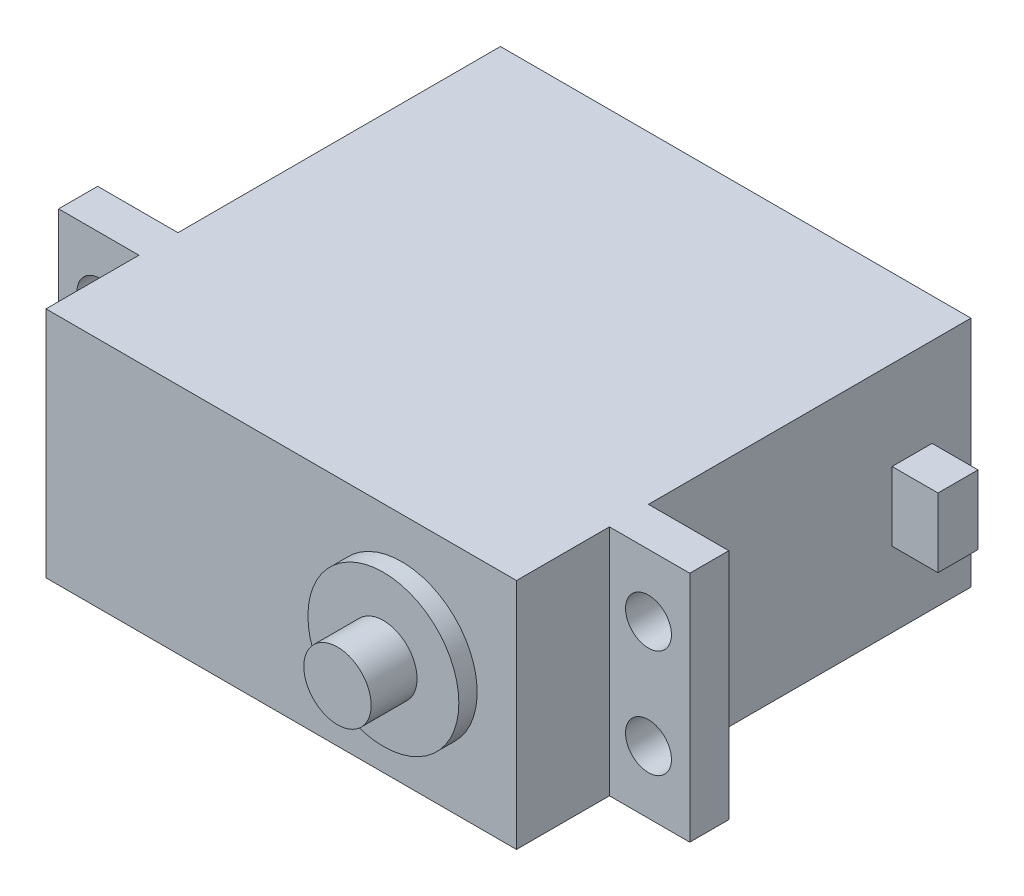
ISO-10303-21;
HEADER;
FILE_DESCRIPTION(('STEP AP214'),'2;1');
FILE_NAME('part.step','',(''),(''),'','','');
FILE_SCHEMA(('AUTOMOTIVE_DESIGN { 1 0 10303 214 1 1 1 1 }'));
ENDSEC;
DATA;
#1=APPLICATION_CONTEXT('core data for automotive mechanical design processes');
#2=APPLICATION_PROTOCOL_DEFINITION('international standard','automotive_design',2000,#1);
#3=PRODUCT_CONTEXT('',#1,'mechanical');
#4=PRODUCT('Part','Part','',(#3));
#5=PRODUCT_RELATED_PRODUCT_CATEGORY('part','',(#4));
#6=PRODUCT_DEFINITION_FORMATION('','',#4);
#7=PRODUCT_DEFINITION_CONTEXT('part definition',#1,'design');
#8=PRODUCT_DEFINITION('design','',#6,#7);
#9=PRODUCT_DEFINITION_SHAPE('','',#8);
#10=(LENGTH_UNIT() NAMED_UNIT(*) SI_UNIT(.MILLI.,.METRE.));
#11=(NAMED_UNIT(*) PLANE_ANGLE_UNIT() SI_UNIT($,.RADIAN.));
#12=(NAMED_UNIT(*) SI_UNIT($,.STERADIAN.) SOLID_ANGLE_UNIT());
#13=UNCERTAINTY_MEASURE_WITH_UNIT(LENGTH_MEASURE(1.E-05),#10,'distance_accuracy_value','');
#14=(GEOMETRIC_REPRESENTATION_CONTEXT(3) GLOBAL_UNCERTAINTY_ASSIGNED_CONTEXT((#13)) GLOBAL_UNIT_ASSIGNED_CONTEXT((#10,
#11,#12)) REPRESENTATION_CONTEXT('',''));
#15=CARTESIAN_POINT('',(0.,0.,0.));
#16=DIRECTION('',(0.,0.,1.));
#17=DIRECTION('',(1.,0.,0.));
#18=AXIS2_PLACEMENT_3D('',#15,#16,#17);
#19=CARTESIAN_POINT('',(41.,20.3,0.));
#20=DIRECTION('',(-1.,0.,0.));
#21=DIRECTION('',(0.,0.,1.));
#22=AXIS2_PLACEMENT_3D('',#19,#20,#21);
#23=PLANE('',#22);
#24=DIRECTION('',(0.,0.,-1.));
#25=VECTOR('',#24,1.);
#26=CARTESIAN_POINT('',(41.,0.,0.));
#27=LINE('',#26,#25);
#28=CARTESIAN_POINT('',(41.,0.,-11.5));
#29=VERTEX_POINT('',#28);
#30=CARTESIAN_POINT('',(41.,0.,-39.6));
#31=VERTEX_POINT('',#30);
#32=EDGE_CURVE('E247',#29,#31,#27,.T.);
#33=ORIENTED_EDGE('',*,*,#32,.T.);
#34=DIRECTION('',(0.,-1.,0.));
#35=VECTOR('',#34,1.);
#36=CARTESIAN_POINT('',(41.,20.3,-39.6));
#37=LINE('',#36,#35);
#38=CARTESIAN_POINT('',(41.,20.3,-39.6));
#39=VERTEX_POINT('',#38);
#40=EDGE_CURVE('E282',#39,#31,#37,.T.);
#41=ORIENTED_EDGE('',*,*,#40,.F.);
#42=DIRECTION('',(0.,0.,-1.));
#43=VECTOR('',#42,1.);
#44=CARTESIAN_POINT('',(41.,20.3,0.));
#45=LINE('',#44,#43);
#46=CARTESIAN_POINT('',(41.,20.3,-11.5));
#47=VERTEX_POINT('',#46);
#48=EDGE_CURVE('E220',#47,#39,#45,.T.);
#49=ORIENTED_EDGE('',*,*,#48,.F.);
#50=DIRECTION('',(0.,-1.,0.));
#51=VECTOR('',#50,1.);
#52=CARTESIAN_POINT('',(41.,20.3,-11.5));
#53=LINE('',#52,#51);
#54=EDGE_CURVE('E284',#47,#29,#53,.T.);
#55=ORIENTED_EDGE('',*,*,#54,.T.);
#56=EDGE_LOOP('',(#33,#41,#49,#55));
#57=FACE_BOUND('',#56,.T.);
#58=DIRECTION('',(0.,-1.,0.));
#59=VECTOR('',#58,1.);
#60=CARTESIAN_POINT('',(41.,12.5393101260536,-32.7313188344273));
#61=LINE('',#60,#59);
#62=CARTESIAN_POINT('',(41.,12.5393101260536,-32.7313188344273));
#63=VERTEX_POINT('',#62);
#64=CARTESIAN_POINT('',(41.,6.52387051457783,-32.7313188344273));
#65=VERTEX_POINT('',#64);
#66=EDGE_CURVE('E178',#63,#65,#61,.T.);
#67=ORIENTED_EDGE('',*,*,#66,.F.);
#68=DIRECTION('',(0.,0.,1.));
#69=VECTOR('',#68,1.);
#70=CARTESIAN_POINT('',(41.,12.5393101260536,-32.7313188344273));
#71=LINE('',#70,#69);
#72=CARTESIAN_POINT('',(41.,12.5393101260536,-36.2169006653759));
#73=VERTEX_POINT('',#72);
#74=EDGE_CURVE('E175',#73,#63,#71,.T.);
#75=ORIENTED_EDGE('',*,*,#74,.F.);
#76=DIRECTION('',(0.,1.,0.));
#77=VECTOR('',#76,1.);
#78=CARTESIAN_POINT('',(41.,12.5393101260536,-36.2169006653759));
#79=LINE('',#78,#77);
#80=CARTESIAN_POINT('',(41.,6.52387051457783,-36.2169006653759));
#81=VERTEX_POINT('',#80);
#82=EDGE_CURVE('E65',#81,#73,#79,.T.);
#83=ORIENTED_EDGE('',*,*,#82,.F.);
#84=DIRECTION('',(0.,0.,-1.));
#85=VECTOR('',#84,1.);
#86=CARTESIAN_POINT('',(41.,6.52387051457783,-32.7313188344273));
#87=LINE('',#86,#85);
#88=EDGE_CURVE('E60',#65,#81,#87,.T.);
#89=ORIENTED_EDGE('',*,*,#88,.F.);
#90=EDGE_LOOP('',(#67,#75,#83,#89));
#91=FACE_BOUND('',#90,.T.);
#92=ADVANCED_FACE('F43',(#57,#91),#23,.F.);
#93=CARTESIAN_POINT('',(0.,20.3,-8.10000000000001));
#94=DIRECTION('',(0.,0.,-1.));
#95=DIRECTION('',(-1.,0.,0.));
#96=AXIS2_PLACEMENT_3D('',#93,#94,#95);
#97=PLANE('',#96);
#98=CARTESIAN_POINT('',(44.4,5.45,-8.10000000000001));
#99=DIRECTION('',(0.,0.,1.));
#100=DIRECTION('',(1.,0.,0.));
#101=AXIS2_PLACEMENT_3D('',#98,#99,#100);
#102=CIRCLE('',#101,2.);
#103=CARTESIAN_POINT('',(46.4,5.45,-8.10000000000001));
#104=VERTEX_POINT('',#103);
#105=EDGE_CURVE('E179',#104,#104,#102,.T.);
#106=ORIENTED_EDGE('',*,*,#105,.F.);
#107=EDGE_LOOP('',(#106));
#108=FACE_BOUND('',#107,.T.);
#109=DIRECTION('',(1.,0.,0.));
#110=VECTOR('',#109,1.);
#111=CARTESIAN_POINT('',(0.,0.,-8.10000000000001));
#112=LINE('',#111,#110);
#113=CARTESIAN_POINT('',(41.,0.,-8.1));
#114=VERTEX_POINT('',#113);
#115=CARTESIAN_POINT('',(48.,0.,-8.1));
#116=VERTEX_POINT('',#115);
#117=EDGE_CURVE('E246',#114,#116,#112,.T.);
#118=ORIENTED_EDGE('',*,*,#117,.T.);
#119=DIRECTION('',(0.,-1.,0.));
#120=VECTOR('',#119,1.);
#121=CARTESIAN_POINT('',(48.,20.3,-8.1));
#122=LINE('',#121,#120);
#123=CARTESIAN_POINT('',(48.,20.3,-8.1));
#124=VERTEX_POINT('',#123);
#125=EDGE_CURVE('E288',#124,#116,#122,.T.);
#126=ORIENTED_EDGE('',*,*,#125,.F.);
#127=DIRECTION('',(1.,0.,0.));
#128=VECTOR('',#127,1.);
#129=CARTESIAN_POINT('',(0.,20.3,-8.10000000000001));
#130=LINE('',#129,#128);
#131=CARTESIAN_POINT('',(41.,20.3,-8.1));
#132=VERTEX_POINT('',#131);
#133=EDGE_CURVE('E219',#132,#124,#130,.T.);
#134=ORIENTED_EDGE('',*,*,#133,.F.);
#135=DIRECTION('',(0.,-1.,0.));
#136=VECTOR('',#135,1.);
#137=CARTESIAN_POINT('',(41.,20.3,-8.1));
#138=LINE('',#137,#136);
#139=EDGE_CURVE('E291',#132,#114,#138,.T.);
#140=ORIENTED_EDGE('',*,*,#139,.T.);
#141=EDGE_LOOP('',(#118,#126,#134,#140));
#142=FACE_BOUND('',#141,.T.);
#143=CARTESIAN_POINT('',(44.4,14.85,-8.10000000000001));
#144=DIRECTION('',(0.,0.,1.));
#145=DIRECTION('',(1.,0.,0.));
#146=AXIS2_PLACEMENT_3D('',#143,#144,#145);
#147=CIRCLE('',#146,2.);
#148=CARTESIAN_POINT('',(46.4,14.85,-8.10000000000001));
#149=VERTEX_POINT('',#148);
#150=EDGE_CURVE('E182',#149,#149,#147,.F.);
#151=ORIENTED_EDGE('',*,*,#150,.T.);
#152=EDGE_LOOP('',(#151));
#153=FACE_BOUND('',#152,.T.);
#154=ADVANCED_FACE('F310',(#108,#142,#153),#97,.F.);
#155=CARTESIAN_POINT('',(0.,20.3,-11.5));
#156=DIRECTION('',(0.,0.,-1.));
#157=DIRECTION('',(-1.,0.,0.));
#158=AXIS2_PLACEMENT_3D('',#155,#156,#157);
#159=PLANE('',#158);
#160=DIRECTION('',(1.,0.,0.));
#161=VECTOR('',#160,1.);
#162=CARTESIAN_POINT('',(0.,0.,-11.5));
#163=LINE('',#162,#161);
#164=CARTESIAN_POINT('',(48.,0.,-11.5));
#165=VERTEX_POINT('',#164);
#166=EDGE_CURVE('E252',#29,#165,#163,.T.);
#167=ORIENTED_EDGE('',*,*,#166,.F.);
#168=ORIENTED_EDGE('',*,*,#54,.F.);
#169=DIRECTION('',(1.,0.,0.));
#170=VECTOR('',#169,1.);
#171=CARTESIAN_POINT('',(0.,20.3,-11.5));
#172=LINE('',#171,#170);
#173=CARTESIAN_POINT('',(48.,20.3,-11.5));
#174=VERTEX_POINT('',#173);
#175=EDGE_CURVE('E224',#47,#174,#172,.T.);
#176=ORIENTED_EDGE('',*,*,#175,.T.);
#177=DIRECTION('',(0.,-1.,0.));
#178=VECTOR('',#177,1.);
#179=CARTESIAN_POINT('',(48.,20.3,-11.5));
#180=LINE('',#179,#178);
#181=EDGE_CURVE('E286',#174,#165,#180,.T.);
#182=ORIENTED_EDGE('',*,*,#181,.T.);
#183=EDGE_LOOP('',(#167,#168,#176,#182));
#184=FACE_BOUND('',#183,.T.);
#185=CARTESIAN_POINT('',(44.4,5.45,-11.5));
#186=DIRECTION('',(0.,0.,-1.));
#187=DIRECTION('',(-1.,0.,0.));
#188=AXIS2_PLACEMENT_3D('',#185,#186,#187);
#189=CIRCLE('',#188,2.);
#190=CARTESIAN_POINT('',(42.4,5.45,-11.5));
#191=VERTEX_POINT('',#190);
#192=EDGE_CURVE('E196',#191,#191,#189,.T.);
#193=ORIENTED_EDGE('',*,*,#192,.F.);
#194=EDGE_LOOP('',(#193));
#195=FACE_BOUND('',#194,.T.);
#196=CARTESIAN_POINT('',(44.4,14.85,-11.5));
#197=DIRECTION('',(0.,0.,-1.));
#198=DIRECTION('',(-1.,0.,0.));
#199=AXIS2_PLACEMENT_3D('',#196,#197,#198);
#200=CIRCLE('',#199,2.);
#201=CARTESIAN_POINT('',(42.4,14.85,-11.5));
#202=VERTEX_POINT('',#201);
#203=EDGE_CURVE('E47',#202,#202,#200,.F.);
#204=ORIENTED_EDGE('',*,*,#203,.T.);
#205=EDGE_LOOP('',(#204));
#206=FACE_BOUND('',#205,.T.);
#207=ADVANCED_FACE('F301',(#184,#195,#206),#159,.T.);
#208=CARTESIAN_POINT('',(0.,20.3,0.));
#209=DIRECTION('',(0.,0.,-1.));
#210=DIRECTION('',(-1.,0.,0.));
#211=AXIS2_PLACEMENT_3D('',#208,#209,#210);
#212=PLANE('',#211);
#213=CARTESIAN_POINT('',(31.,10.15,0.));
#214=DIRECTION('',(0.,0.,-1.));
#215=DIRECTION('',(-1.,0.,0.));
#216=AXIS2_PLACEMENT_3D('',#213,#214,#215);
#217=CIRCLE('',#216,6.575);
#218=CARTESIAN_POINT('',(24.425,10.15,0.));
#219=VERTEX_POINT('',#218);
#220=EDGE_CURVE('E12',#219,#219,#217,.F.);
#221=ORIENTED_EDGE('',*,*,#220,.F.);
#222=EDGE_LOOP('',(#221));
#223=FACE_BOUND('',#222,.T.);
#224=DIRECTION('',(1.,0.,0.));
#225=VECTOR('',#224,1.);
#226=CARTESIAN_POINT('',(0.,0.,0.));
#227=LINE('',#226,#225);
#228=CARTESIAN_POINT('',(0.,0.,0.));
#229=VERTEX_POINT('',#228);
#230=CARTESIAN_POINT('',(41.,0.,0.));
#231=VERTEX_POINT('',#230);
#232=EDGE_CURVE('E212',#229,#231,#227,.T.);
#233=ORIENTED_EDGE('',*,*,#232,.T.);
#234=DIRECTION('',(0.,-1.,0.));
#235=VECTOR('',#234,1.);
#236=CARTESIAN_POINT('',(41.,20.3,0.));
#237=LINE('',#236,#235);
#238=CARTESIAN_POINT('',(41.,20.3,0.));
#239=VERTEX_POINT('',#238);
#240=EDGE_CURVE('E52',#239,#231,#237,.T.);
#241=ORIENTED_EDGE('',*,*,#240,.F.);
#242=DIRECTION('',(1.,0.,0.));
#243=VECTOR('',#242,1.);
#244=CARTESIAN_POINT('',(0.,20.3,0.));
#245=LINE('',#244,#243);
#246=CARTESIAN_POINT('',(0.,20.3,0.));
#247=VERTEX_POINT('',#246);
#248=EDGE_CURVE('E213',#247,#239,#245,.T.);
#249=ORIENTED_EDGE('',*,*,#248,.F.);
#250=DIRECTION('',(0.,-1.,0.));
#251=VECTOR('',#250,1.);
#252=CARTESIAN_POINT('',(0.,20.3,0.));
#253=LINE('',#252,#251);
#254=EDGE_CURVE('E270',#247,#229,#253,.T.);
#255=ORIENTED_EDGE('',*,*,#254,.T.);
#256=EDGE_LOOP('',(#233,#241,#249,#255));
#257=FACE_BOUND('',#256,.T.);
#258=ADVANCED_FACE('F45',(#223,#257),#212,.F.);
#259=EDGE_CURVE('E244',#231,#114,#27,.T.);
#260=ORIENTED_EDGE('',*,*,#259,.T.);
#261=ORIENTED_EDGE('',*,*,#139,.F.);
#262=EDGE_CURVE('E216',#239,#132,#45,.T.);
#263=ORIENTED_EDGE('',*,*,#262,.F.);
#264=ORIENTED_EDGE('',*,*,#240,.T.);
#265=EDGE_LOOP('',(#260,#261,#263,#264));
#266=FACE_BOUND('',#265,.T.);
#267=ADVANCED_FACE('F321',(#266),#23,.F.);
#268=CARTESIAN_POINT('',(48.,20.3,0.));
#269=DIRECTION('',(-1.,0.,0.));
#270=DIRECTION('',(0.,0.,1.));
#271=AXIS2_PLACEMENT_3D('',#268,#269,#270);
#272=PLANE('',#271);
#273=DIRECTION('',(0.,0.,-1.));
#274=VECTOR('',#273,1.);
#275=CARTESIAN_POINT('',(48.,0.,0.));
#276=LINE('',#275,#274);
#277=EDGE_CURVE('E249',#116,#165,#276,.T.);
#278=ORIENTED_EDGE('',*,*,#277,.T.);
#279=ORIENTED_EDGE('',*,*,#181,.F.);
#280=DIRECTION('',(0.,0.,-1.));
#281=VECTOR('',#280,1.);
#282=CARTESIAN_POINT('',(48.,20.3,0.));
#283=LINE('',#282,#281);
#284=EDGE_CURVE('E222',#124,#174,#283,.T.);
#285=ORIENTED_EDGE('',*,*,#284,.F.);
#286=ORIENTED_EDGE('',*,*,#125,.T.);
#287=EDGE_LOOP('',(#278,#279,#285,#286));
#288=FACE_BOUND('',#287,.T.);
#289=ADVANCED_FACE('F325',(#288),#272,.F.);
#290=CARTESIAN_POINT('',(0.,20.3,-39.6));
#291=DIRECTION('',(0.,0.,-1.));
#292=DIRECTION('',(-1.,0.,0.));
#293=AXIS2_PLACEMENT_3D('',#290,#291,#292);
#294=PLANE('',#293);
#295=DIRECTION('',(1.,0.,0.));
#296=VECTOR('',#295,1.);
#297=CARTESIAN_POINT('',(0.,0.,-39.6));
#298=LINE('',#297,#296);
#299=CARTESIAN_POINT('',(0.,0.,-39.6));
#300=VERTEX_POINT('',#299);
#301=EDGE_CURVE('E255',#300,#31,#298,.T.);
#302=ORIENTED_EDGE('',*,*,#301,.F.);
#303=DIRECTION('',(0.,-1.,0.));
#304=VECTOR('',#303,1.);
#305=CARTESIAN_POINT('',(0.,20.3,-39.6));
#306=LINE('',#305,#304);
#307=CARTESIAN_POINT('',(0.,20.3,-39.6));
#308=VERTEX_POINT('',#307);
#309=EDGE_CURVE('E280',#308,#300,#306,.T.);
#310=ORIENTED_EDGE('',*,*,#309,.F.);
#311=DIRECTION('',(1.,0.,0.));
#312=VECTOR('',#311,1.);
#313=CARTESIAN_POINT('',(0.,20.3,-39.6));
#314=LINE('',#313,#312);
#315=EDGE_CURVE('E227',#308,#39,#314,.T.);
#316=ORIENTED_EDGE('',*,*,#315,.T.);
#317=ORIENTED_EDGE('',*,*,#40,.T.);
#318=EDGE_LOOP('',(#302,#310,#316,#317));
#319=FACE_BOUND('',#318,.T.);
#320=ADVANCED_FACE('F327',(#319),#294,.T.);
#321=CARTESIAN_POINT('',(0.,20.3,0.));
#322=DIRECTION('',(-1.,0.,0.));
#323=DIRECTION('',(0.,0.,1.));
#324=AXIS2_PLACEMENT_3D('',#321,#322,#323);
#325=PLANE('',#324);
#326=DIRECTION('',(0.,0.,-1.));
#327=VECTOR('',#326,1.);
#328=CARTESIAN_POINT('',(0.,0.,0.));
#329=LINE('',#328,#327);
#330=CARTESIAN_POINT('',(0.,0.,-11.5));
#331=VERTEX_POINT('',#330);
#332=EDGE_CURVE('E258',#331,#300,#329,.T.);
#333=ORIENTED_EDGE('',*,*,#332,.F.);
#334=DIRECTION('',(0.,-1.,0.));
#335=VECTOR('',#334,1.);
#336=CARTESIAN_POINT('',(0.,20.3,-11.5));
#337=LINE('',#336,#335);
#338=CARTESIAN_POINT('',(0.,20.3,-11.5));
#339=VERTEX_POINT('',#338);
#340=EDGE_CURVE('E278',#339,#331,#337,.T.);
#341=ORIENTED_EDGE('',*,*,#340,.F.);
#342=DIRECTION('',(0.,0.,-1.));
#343=VECTOR('',#342,1.);
#344=CARTESIAN_POINT('',(0.,20.3,0.));
#345=LINE('',#344,#343);
#346=EDGE_CURVE('E230',#339,#308,#345,.T.);
#347=ORIENTED_EDGE('',*,*,#346,.T.);
#348=ORIENTED_EDGE('',*,*,#309,.T.);
#349=EDGE_LOOP('',(#333,#341,#347,#348));
#350=FACE_BOUND('',#349,.T.);
#351=ADVANCED_FACE('F332',(#350),#325,.T.);
#352=CARTESIAN_POINT('',(0.,20.3,-11.5));
#353=DIRECTION('',(0.,0.,1.));
#354=DIRECTION('',(1.,0.,0.));
#355=AXIS2_PLACEMENT_3D('',#352,#353,#354);
#356=PLANE('',#355);
#357=CARTESIAN_POINT('',(-3.4,5.45,-11.5));
#358=DIRECTION('',(0.,0.,1.));
#359=DIRECTION('',(1.,0.,0.));
#360=AXIS2_PLACEMENT_3D('',#357,#358,#359);
#361=CIRCLE('',#360,2.);
#362=CARTESIAN_POINT('',(-1.39999999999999,5.45,-11.5));
#363=VERTEX_POINT('',#362);
#364=EDGE_CURVE('E191',#363,#363,#361,.F.);
#365=ORIENTED_EDGE('',*,*,#364,.F.);
#366=EDGE_LOOP('',(#365));
#367=FACE_BOUND('',#366,.T.);
#368=CARTESIAN_POINT('',(-3.4,14.85,-11.5));
#369=DIRECTION('',(0.,0.,1.));
#370=DIRECTION('',(1.,0.,0.));
#371=AXIS2_PLACEMENT_3D('',#368,#369,#370);
#372=CIRCLE('',#371,2.);
#373=CARTESIAN_POINT('',(-1.39999999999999,14.85,-11.5));
#374=VERTEX_POINT('',#373);
#375=EDGE_CURVE('E200',#374,#374,#372,.T.);
#376=ORIENTED_EDGE('',*,*,#375,.T.);
#377=EDGE_LOOP('',(#376));
#378=FACE_BOUND('',#377,.T.);
#379=DIRECTION('',(-1.,0.,0.));
#380=VECTOR('',#379,1.);
#381=CARTESIAN_POINT('',(0.,0.,-11.5));
#382=LINE('',#381,#380);
#383=CARTESIAN_POINT('',(-7.,0.,-11.5));
#384=VERTEX_POINT('',#383);
#385=EDGE_CURVE('E261',#331,#384,#382,.T.);
#386=ORIENTED_EDGE('',*,*,#385,.T.);
#387=DIRECTION('',(0.,-1.,0.));
#388=VECTOR('',#387,1.);
#389=CARTESIAN_POINT('',(-7.,20.3,-11.5));
#390=LINE('',#389,#388);
#391=CARTESIAN_POINT('',(-7.,20.3,-11.5));
#392=VERTEX_POINT('',#391);
#393=EDGE_CURVE('E276',#392,#384,#390,.T.);
#394=ORIENTED_EDGE('',*,*,#393,.F.);
#395=DIRECTION('',(-1.,0.,0.));
#396=VECTOR('',#395,1.);
#397=CARTESIAN_POINT('',(0.,20.3,-11.5));
#398=LINE('',#397,#396);
#399=EDGE_CURVE('E233',#339,#392,#398,.T.);
#400=ORIENTED_EDGE('',*,*,#399,.F.);
#401=ORIENTED_EDGE('',*,*,#340,.T.);
#402=EDGE_LOOP('',(#386,#394,#400,#401));
#403=FACE_BOUND('',#402,.T.);
#404=ADVANCED_FACE('F334',(#367,#378,#403),#356,.F.);
#405=CARTESIAN_POINT('',(-7.,20.3,0.));
#406=DIRECTION('',(-1.,0.,0.));
#407=DIRECTION('',(0.,0.,1.));
#408=AXIS2_PLACEMENT_3D('',#405,#406,#407);
#409=PLANE('',#408);
#410=DIRECTION('',(0.,0.,-1.));
#411=VECTOR('',#410,1.);
#412=CARTESIAN_POINT('',(-7.,0.,0.));
#413=LINE('',#412,#411);
#414=CARTESIAN_POINT('',(-7.,0.,-8.1));
#415=VERTEX_POINT('',#414);
#416=EDGE_CURVE('E264',#415,#384,#413,.T.);
#417=ORIENTED_EDGE('',*,*,#416,.F.);
#418=DIRECTION('',(0.,-1.,0.));
#419=VECTOR('',#418,1.);
#420=CARTESIAN_POINT('',(-7.,20.3,-8.1));
#421=LINE('',#420,#419);
#422=CARTESIAN_POINT('',(-7.,20.3,-8.1));
#423=VERTEX_POINT('',#422);
#424=EDGE_CURVE('E274',#423,#415,#421,.T.);
#425=ORIENTED_EDGE('',*,*,#424,.F.);
#426=DIRECTION('',(0.,0.,-1.));
#427=VECTOR('',#426,1.);
#428=CARTESIAN_POINT('',(-7.,20.3,0.));
#429=LINE('',#428,#427);
#430=EDGE_CURVE('E236',#423,#392,#429,.T.);
#431=ORIENTED_EDGE('',*,*,#430,.T.);
#432=ORIENTED_EDGE('',*,*,#393,.T.);
#433=EDGE_LOOP('',(#417,#425,#431,#432));
#434=FACE_BOUND('',#433,.T.);
#435=ADVANCED_FACE('F337',(#434),#409,.T.);
#436=CARTESIAN_POINT('',(0.,20.3,-8.1));
#437=DIRECTION('',(0.,0.,1.));
#438=DIRECTION('',(1.,0.,0.));
#439=AXIS2_PLACEMENT_3D('',#436,#437,#438);
#440=PLANE('',#439);
#441=CARTESIAN_POINT('',(-3.4,5.45,-8.10000000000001));
#442=DIRECTION('',(0.,0.,1.));
#443=DIRECTION('',(1.,0.,0.));
#444=AXIS2_PLACEMENT_3D('',#441,#442,#443);
#445=CIRCLE('',#444,2.);
#446=CARTESIAN_POINT('',(-1.39999999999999,5.45,-8.10000000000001));
#447=VERTEX_POINT('',#446);
#448=EDGE_CURVE('E188',#447,#447,#445,.F.);
#449=ORIENTED_EDGE('',*,*,#448,.T.);
#450=EDGE_LOOP('',(#449));
#451=FACE_BOUND('',#450,.T.);
#452=CARTESIAN_POINT('',(-3.4,14.85,-8.10000000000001));
#453=DIRECTION('',(0.,0.,1.));
#454=DIRECTION('',(1.,0.,0.));
#455=AXIS2_PLACEMENT_3D('',#452,#453,#454);
#456=CIRCLE('',#455,2.);
#457=CARTESIAN_POINT('',(-1.39999999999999,14.85,-8.10000000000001));
#458=VERTEX_POINT('',#457);
#459=EDGE_CURVE('E197',#458,#458,#456,.T.);
#460=ORIENTED_EDGE('',*,*,#459,.F.);
#461=EDGE_LOOP('',(#460));
#462=FACE_BOUND('',#461,.T.);
#463=DIRECTION('',(-1.,0.,0.));
#464=VECTOR('',#463,1.);
#465=CARTESIAN_POINT('',(0.,0.,-8.1));
#466=LINE('',#465,#464);
#467=CARTESIAN_POINT('',(0.,0.,-8.1));
#468=VERTEX_POINT('',#467);
#469=EDGE_CURVE('E267',#468,#415,#466,.T.);
#470=ORIENTED_EDGE('',*,*,#469,.F.);
#471=DIRECTION('',(0.,-1.,0.));
#472=VECTOR('',#471,1.);
#473=CARTESIAN_POINT('',(0.,20.3,-8.1));
#474=LINE('',#473,#472);
#475=CARTESIAN_POINT('',(0.,20.3,-8.1));
#476=VERTEX_POINT('',#475);
#477=EDGE_CURVE('E272',#476,#468,#474,.T.);
#478=ORIENTED_EDGE('',*,*,#477,.F.);
#479=DIRECTION('',(-1.,0.,0.));
#480=VECTOR('',#479,1.);
#481=CARTESIAN_POINT('',(0.,20.3,-8.1));
#482=LINE('',#481,#480);
#483=EDGE_CURVE('E239',#476,#423,#482,.T.);
#484=ORIENTED_EDGE('',*,*,#483,.T.);
#485=ORIENTED_EDGE('',*,*,#424,.T.);
#486=EDGE_LOOP('',(#470,#478,#484,#485));
#487=FACE_BOUND('',#486,.T.);
#488=ADVANCED_FACE('F341',(#451,#462,#487),#440,.T.);
#489=EDGE_CURVE('E217',#229,#468,#329,.T.);
#490=ORIENTED_EDGE('',*,*,#489,.F.);
#491=ORIENTED_EDGE('',*,*,#254,.F.);
#492=EDGE_CURVE('E234',#247,#476,#345,.T.);
#493=ORIENTED_EDGE('',*,*,#492,.T.);
#494=ORIENTED_EDGE('',*,*,#477,.T.);
#495=EDGE_LOOP('',(#490,#491,#493,#494));
#496=FACE_BOUND('',#495,.T.);
#497=ADVANCED_FACE('F345',(#496),#325,.T.);
#498=CARTESIAN_POINT('',(0.,20.3,0.));
#499=DIRECTION('',(0.,1.,0.));
#500=DIRECTION('',(0.,0.,1.));
#501=AXIS2_PLACEMENT_3D('',#498,#499,#500);
#502=PLANE('',#501);
#503=ORIENTED_EDGE('',*,*,#248,.T.);
#504=ORIENTED_EDGE('',*,*,#262,.T.);
#505=ORIENTED_EDGE('',*,*,#133,.T.);
#506=ORIENTED_EDGE('',*,*,#284,.T.);
#507=ORIENTED_EDGE('',*,*,#175,.F.);
#508=ORIENTED_EDGE('',*,*,#48,.T.);
#509=ORIENTED_EDGE('',*,*,#315,.F.);
#510=ORIENTED_EDGE('',*,*,#346,.F.);
#511=ORIENTED_EDGE('',*,*,#399,.T.);
#512=ORIENTED_EDGE('',*,*,#430,.F.);
#513=ORIENTED_EDGE('',*,*,#483,.F.);
#514=ORIENTED_EDGE('',*,*,#492,.F.);
#515=EDGE_LOOP('',(#503,#504,#505,#506,#507,#508,#509,#510,#511,#512,#513,#514));
#516=FACE_BOUND('',#515,.T.);
#517=ADVANCED_FACE('F349',(#516),#502,.T.);
#518=CARTESIAN_POINT('',(0.,0.,0.));
#519=DIRECTION('',(0.,1.,0.));
#520=DIRECTION('',(0.,0.,1.));
#521=AXIS2_PLACEMENT_3D('',#518,#519,#520);
#522=PLANE('',#521);
#523=ORIENTED_EDGE('',*,*,#232,.F.);
#524=ORIENTED_EDGE('',*,*,#489,.T.);
#525=ORIENTED_EDGE('',*,*,#469,.T.);
#526=ORIENTED_EDGE('',*,*,#416,.T.);
#527=ORIENTED_EDGE('',*,*,#385,.F.);
#528=ORIENTED_EDGE('',*,*,#332,.T.);
#529=ORIENTED_EDGE('',*,*,#301,.T.);
#530=ORIENTED_EDGE('',*,*,#32,.F.);
#531=ORIENTED_EDGE('',*,*,#166,.T.);
#532=ORIENTED_EDGE('',*,*,#277,.F.);
#533=ORIENTED_EDGE('',*,*,#117,.F.);
#534=ORIENTED_EDGE('',*,*,#259,.F.);
#535=EDGE_LOOP('',(#523,#524,#525,#526,#527,#528,#529,#530,#531,#532,#533,#534));
#536=FACE_BOUND('',#535,.T.);
#537=ADVANCED_FACE('F351',(#536),#522,.F.);
#538=CARTESIAN_POINT('',(31.,10.15,1.6));
#539=DIRECTION('',(0.,0.,-1.));
#540=DIRECTION('',(-1.,0.,0.));
#541=AXIS2_PLACEMENT_3D('',#538,#539,#540);
#542=CYLINDRICAL_SURFACE('',#541,6.575);
#543=CARTESIAN_POINT('',(31.,10.15,1.6));
#544=DIRECTION('',(0.,0.,1.));
#545=DIRECTION('',(1.,0.,0.));
#546=AXIS2_PLACEMENT_3D('',#543,#544,#545);
#547=CIRCLE('',#546,6.575);
#548=CARTESIAN_POINT('',(37.575,10.15,1.6));
#549=VERTEX_POINT('',#548);
#550=EDGE_CURVE('E207',#549,#549,#547,.T.);
#551=ORIENTED_EDGE('',*,*,#550,.F.);
#552=EDGE_LOOP('',(#551));
#553=FACE_BOUND('',#552,.T.);
#554=ORIENTED_EDGE('',*,*,#220,.T.);
#555=EDGE_LOOP('',(#554));
#556=FACE_BOUND('',#555,.T.);
#557=ADVANCED_FACE('F354',(#553,#556),#542,.T.);
#558=CARTESIAN_POINT('',(0.,0.,1.6));
#559=DIRECTION('',(0.,0.,1.));
#560=DIRECTION('',(1.,0.,0.));
#561=AXIS2_PLACEMENT_3D('',#558,#559,#560);
#562=PLANE('',#561);
#563=CARTESIAN_POINT('',(31.,10.15,1.6));
#564=DIRECTION('',(0.,0.,1.));
#565=DIRECTION('',(1.,0.,0.));
#566=AXIS2_PLACEMENT_3D('',#563,#564,#565);
#567=CIRCLE('',#566,2.935);
#568=CARTESIAN_POINT('',(33.935,10.15,1.6));
#569=VERTEX_POINT('',#568);
#570=EDGE_CURVE('E203',#569,#569,#567,.T.);
#571=ORIENTED_EDGE('',*,*,#570,.F.);
#572=EDGE_LOOP('',(#571));
#573=FACE_BOUND('',#572,.T.);
#574=ORIENTED_EDGE('',*,*,#550,.T.);
#575=EDGE_LOOP('',(#574));
#576=FACE_BOUND('',#575,.T.);
#577=ADVANCED_FACE('F361',(#573,#576),#562,.T.);
#578=CARTESIAN_POINT('',(31.,10.15,5.6));
#579=DIRECTION('',(0.,0.,-1.));
#580=DIRECTION('',(-1.,0.,0.));
#581=AXIS2_PLACEMENT_3D('',#578,#579,#580);
#582=CYLINDRICAL_SURFACE('',#581,2.935);
#583=CARTESIAN_POINT('',(31.,10.15,5.6));
#584=DIRECTION('',(0.,0.,1.));
#585=DIRECTION('',(1.,0.,0.));
#586=AXIS2_PLACEMENT_3D('',#583,#584,#585);
#587=CIRCLE('',#586,2.935);
#588=CARTESIAN_POINT('',(33.935,10.15,5.6));
#589=VERTEX_POINT('',#588);
#590=EDGE_CURVE('E204',#589,#589,#587,.T.);
#591=ORIENTED_EDGE('',*,*,#590,.F.);
#592=EDGE_LOOP('',(#591));
#593=FACE_BOUND('',#592,.T.);
#594=ORIENTED_EDGE('',*,*,#570,.T.);
#595=EDGE_LOOP('',(#594));
#596=FACE_BOUND('',#595,.T.);
#597=ADVANCED_FACE('F365',(#593,#596),#582,.T.);
#598=CARTESIAN_POINT('',(31.,10.15,5.6));
#599=DIRECTION('',(0.,0.,1.));
#600=DIRECTION('',(1.,0.,0.));
#601=AXIS2_PLACEMENT_3D('',#598,#599,#600);
#602=PLANE('',#601);
#603=ORIENTED_EDGE('',*,*,#590,.T.);
#604=EDGE_LOOP('',(#603));
#605=FACE_BOUND('',#604,.T.);
#606=ADVANCED_FACE('F369',(#605),#602,.T.);
#607=CARTESIAN_POINT('',(-3.4,14.85,-39.6));
#608=DIRECTION('',(0.,0.,1.));
#609=DIRECTION('',(1.,0.,0.));
#610=AXIS2_PLACEMENT_3D('',#607,#608,#609);
#611=CYLINDRICAL_SURFACE('',#610,2.);
#612=ORIENTED_EDGE('',*,*,#459,.T.);
#613=EDGE_LOOP('',(#612));
#614=FACE_BOUND('',#613,.T.);
#615=ORIENTED_EDGE('',*,*,#375,.F.);
#616=EDGE_LOOP('',(#615));
#617=FACE_BOUND('',#616,.T.);
#618=ADVANCED_FACE('F373',(#614,#617),#611,.F.);
#619=CARTESIAN_POINT('',(-3.4,5.45,-39.6));
#620=DIRECTION('',(0.,0.,1.));
#621=DIRECTION('',(1.,0.,0.));
#622=AXIS2_PLACEMENT_3D('',#619,#620,#621);
#623=CYLINDRICAL_SURFACE('',#622,2.);
#624=ORIENTED_EDGE('',*,*,#448,.F.);
#625=EDGE_LOOP('',(#624));
#626=FACE_BOUND('',#625,.T.);
#627=ORIENTED_EDGE('',*,*,#364,.T.);
#628=EDGE_LOOP('',(#627));
#629=FACE_BOUND('',#628,.T.);
#630=ADVANCED_FACE('F377',(#626,#629),#623,.F.);
#631=CARTESIAN_POINT('',(44.4,5.45,-39.6));
#632=DIRECTION('',(0.,0.,1.));
#633=DIRECTION('',(1.,0.,0.));
#634=AXIS2_PLACEMENT_3D('',#631,#632,#633);
#635=CYLINDRICAL_SURFACE('',#634,2.);
#636=ORIENTED_EDGE('',*,*,#192,.T.);
#637=EDGE_LOOP('',(#636));
#638=FACE_BOUND('',#637,.T.);
#639=ORIENTED_EDGE('',*,*,#105,.T.);
#640=EDGE_LOOP('',(#639));
#641=FACE_BOUND('',#640,.T.);
#642=ADVANCED_FACE('F306',(#638,#641),#635,.F.);
#643=CARTESIAN_POINT('',(44.4,14.85,-39.6));
#644=DIRECTION('',(0.,0.,1.));
#645=DIRECTION('',(1.,0.,0.));
#646=AXIS2_PLACEMENT_3D('',#643,#644,#645);
#647=CYLINDRICAL_SURFACE('',#646,2.);
#648=ORIENTED_EDGE('',*,*,#203,.F.);
#649=EDGE_LOOP('',(#648));
#650=FACE_BOUND('',#649,.T.);
#651=ORIENTED_EDGE('',*,*,#150,.F.);
#652=EDGE_LOOP('',(#651));
#653=FACE_BOUND('',#652,.T.);
#654=ADVANCED_FACE('F303',(#650,#653),#647,.F.);
#655=CARTESIAN_POINT('',(45.,12.5393101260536,-32.7313188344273));
#656=DIRECTION('',(0.,0.,-1.));
#657=DIRECTION('',(-1.,0.,0.));
#658=AXIS2_PLACEMENT_3D('',#655,#656,#657);
#659=PLANE('',#658);
#660=ORIENTED_EDGE('',*,*,#66,.T.);
#661=DIRECTION('',(-1.,0.,0.));
#662=VECTOR('',#661,1.);
#663=CARTESIAN_POINT('',(45.,6.52387051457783,-32.7313188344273));
#664=LINE('',#663,#662);
#665=CARTESIAN_POINT('',(45.,6.52387051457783,-32.7313188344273));
#666=VERTEX_POINT('',#665);
#667=EDGE_CURVE('E159',#666,#65,#664,.T.);
#668=ORIENTED_EDGE('',*,*,#667,.F.);
#669=DIRECTION('',(0.,-1.,0.));
#670=VECTOR('',#669,1.);
#671=CARTESIAN_POINT('',(45.,12.5393101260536,-32.7313188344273));
#672=LINE('',#671,#670);
#673=CARTESIAN_POINT('',(45.,12.5393101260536,-32.7313188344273));
#674=VERTEX_POINT('',#673);
#675=EDGE_CURVE('E166',#674,#666,#672,.T.);
#676=ORIENTED_EDGE('',*,*,#675,.F.);
#677=DIRECTION('',(-1.,0.,0.));
#678=VECTOR('',#677,1.);
#679=CARTESIAN_POINT('',(45.,12.5393101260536,-32.7313188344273));
#680=LINE('',#679,#678);
#681=EDGE_CURVE('E632',#674,#63,#680,.T.);
#682=ORIENTED_EDGE('',*,*,#681,.T.);
#683=EDGE_LOOP('',(#660,#668,#676,#682));
#684=FACE_BOUND('',#683,.T.);
#685=ADVANCED_FACE('F177',(#684),#659,.F.);
#686=CARTESIAN_POINT('',(45.,6.52387051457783,-32.7313188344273));
#687=DIRECTION('',(0.,1.,0.));
#688=DIRECTION('',(0.,0.,1.));
#689=AXIS2_PLACEMENT_3D('',#686,#687,#688);
#690=PLANE('',#689);
#691=ORIENTED_EDGE('',*,*,#88,.T.);
#692=DIRECTION('',(-1.,0.,0.));
#693=VECTOR('',#692,1.);
#694=CARTESIAN_POINT('',(45.,6.52387051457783,-36.2169006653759));
#695=LINE('',#694,#693);
#696=CARTESIAN_POINT('',(45.,6.52387051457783,-36.2169006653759));
#697=VERTEX_POINT('',#696);
#698=EDGE_CURVE('E162',#697,#81,#695,.T.);
#699=ORIENTED_EDGE('',*,*,#698,.F.);
#700=DIRECTION('',(0.,0.,-1.));
#701=VECTOR('',#700,1.);
#702=CARTESIAN_POINT('',(45.,6.52387051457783,-32.7313188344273));
#703=LINE('',#702,#701);
#704=EDGE_CURVE('E155',#666,#697,#703,.T.);
#705=ORIENTED_EDGE('',*,*,#704,.F.);
#706=ORIENTED_EDGE('',*,*,#667,.T.);
#707=EDGE_LOOP('',(#691,#699,#705,#706));
#708=FACE_BOUND('',#707,.T.);
#709=ADVANCED_FACE('F157',(#708),#690,.F.);
#710=CARTESIAN_POINT('',(45.,12.5393101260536,-36.2169006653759));
#711=DIRECTION('',(0.,0.,1.));
#712=DIRECTION('',(1.,0.,0.));
#713=AXIS2_PLACEMENT_3D('',#710,#711,#712);
#714=PLANE('',#713);
#715=ORIENTED_EDGE('',*,*,#82,.T.);
#716=DIRECTION('',(-1.,0.,0.));
#717=VECTOR('',#716,1.);
#718=CARTESIAN_POINT('',(45.,12.5393101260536,-36.2169006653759));
#719=LINE('',#718,#717);
#720=CARTESIAN_POINT('',(45.,12.5393101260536,-36.2169006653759));
#721=VERTEX_POINT('',#720);
#722=EDGE_CURVE('E184',#721,#73,#719,.T.);
#723=ORIENTED_EDGE('',*,*,#722,.F.);
#724=DIRECTION('',(0.,1.,0.));
#725=VECTOR('',#724,1.);
#726=CARTESIAN_POINT('',(45.,12.5393101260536,-36.2169006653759));
#727=LINE('',#726,#725);
#728=EDGE_CURVE('E165',#697,#721,#727,.T.);
#729=ORIENTED_EDGE('',*,*,#728,.F.);
#730=ORIENTED_EDGE('',*,*,#698,.T.);
#731=EDGE_LOOP('',(#715,#723,#729,#730));
#732=FACE_BOUND('',#731,.T.);
#733=ADVANCED_FACE('F388',(#732),#714,.F.);
#734=CARTESIAN_POINT('',(45.,12.5393101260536,-32.7313188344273));
#735=DIRECTION('',(0.,-1.,0.));
#736=DIRECTION('',(0.,0.,-1.));
#737=AXIS2_PLACEMENT_3D('',#734,#735,#736);
#738=PLANE('',#737);
#739=ORIENTED_EDGE('',*,*,#74,.T.);
#740=ORIENTED_EDGE('',*,*,#681,.F.);
#741=DIRECTION('',(0.,0.,1.));
#742=VECTOR('',#741,1.);
#743=CARTESIAN_POINT('',(45.,12.5393101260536,-32.7313188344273));
#744=LINE('',#743,#742);
#745=EDGE_CURVE('E171',#721,#674,#744,.T.);
#746=ORIENTED_EDGE('',*,*,#745,.F.);
#747=ORIENTED_EDGE('',*,*,#722,.T.);
#748=EDGE_LOOP('',(#739,#740,#746,#747));
#749=FACE_BOUND('',#748,.T.);
#750=ADVANCED_FACE('F391',(#749),#738,.F.);
#751=CARTESIAN_POINT('',(45.,0.,0.));
#752=DIRECTION('',(1.,0.,0.));
#753=DIRECTION('',(0.,0.,-1.));
#754=AXIS2_PLACEMENT_3D('',#751,#752,#753);
#755=PLANE('',#754);
#756=ORIENTED_EDGE('',*,*,#675,.T.);
#757=ORIENTED_EDGE('',*,*,#704,.T.);
#758=ORIENTED_EDGE('',*,*,#728,.T.);
#759=ORIENTED_EDGE('',*,*,#745,.T.);
#760=EDGE_LOOP('',(#756,#757,#758,#759));
#761=FACE_BOUND('',#760,.T.);
#762=ADVANCED_FACE('F169',(#761),#755,.T.);
#763=CLOSED_SHELL('',(#92,#154,#207,#258,#267,#289,#320,#351,#404,#435,#488,#497,#517,#537,#557,
#577,#597,#606,#618,#630,#642,#654,#685,#709,#733,#750,#762));
#764=MANIFOLD_SOLID_BREP('B2',#763);
#765=ADVANCED_BREP_SHAPE_REPRESENTATION('',(#18,#764),#14);
#766=SHAPE_DEFINITION_REPRESENTATION(#9,#765);
ENDSEC;
END-ISO-10303-21;
